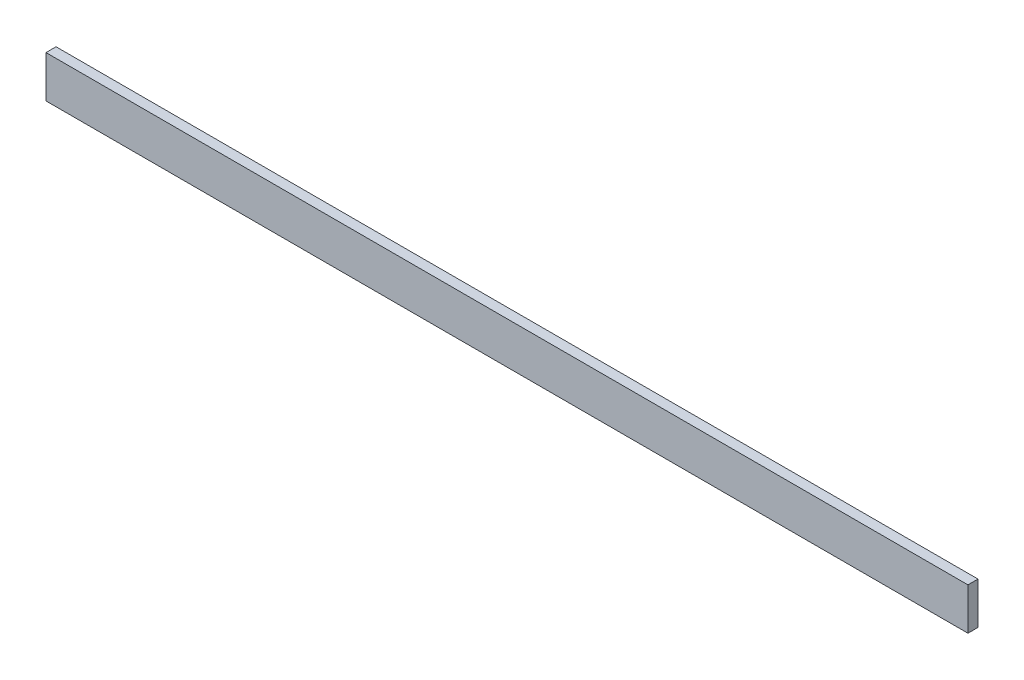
ISO-10303-21;
HEADER;
FILE_DESCRIPTION(('STEP AP214'),'2;1');
FILE_NAME('part.step','',(''),(''),'','','');
FILE_SCHEMA(('AUTOMOTIVE_DESIGN { 1 0 10303 214 1 1 1 1 }'));
ENDSEC;
DATA;
#1=APPLICATION_CONTEXT('core data for automotive mechanical design processes');
#2=APPLICATION_PROTOCOL_DEFINITION('international standard','automotive_design',2000,#1);
#3=PRODUCT_CONTEXT('',#1,'mechanical');
#4=PRODUCT('Part','Part','',(#3));
#5=PRODUCT_RELATED_PRODUCT_CATEGORY('part','',(#4));
#6=PRODUCT_DEFINITION_FORMATION('','',#4);
#7=PRODUCT_DEFINITION_CONTEXT('part definition',#1,'design');
#8=PRODUCT_DEFINITION('design','',#6,#7);
#9=PRODUCT_DEFINITION_SHAPE('','',#8);
#10=(LENGTH_UNIT() NAMED_UNIT(*) SI_UNIT(.MILLI.,.METRE.));
#11=(NAMED_UNIT(*) PLANE_ANGLE_UNIT() SI_UNIT($,.RADIAN.));
#12=(NAMED_UNIT(*) SI_UNIT($,.STERADIAN.) SOLID_ANGLE_UNIT());
#13=UNCERTAINTY_MEASURE_WITH_UNIT(LENGTH_MEASURE(1.E-05),#10,'distance_accuracy_value','');
#14=(GEOMETRIC_REPRESENTATION_CONTEXT(3) GLOBAL_UNCERTAINTY_ASSIGNED_CONTEXT((#13)) GLOBAL_UNIT_ASSIGNED_CONTEXT((#10,
#11,#12)) REPRESENTATION_CONTEXT('',''));
#15=CARTESIAN_POINT('',(0.,0.,0.));
#16=DIRECTION('',(0.,0.,1.));
#17=DIRECTION('',(1.,0.,0.));
#18=AXIS2_PLACEMENT_3D('',#15,#16,#17);
#19=CARTESIAN_POINT('',(550.,25.,12.));
#20=DIRECTION('',(-1.,0.,0.));
#21=DIRECTION('',(0.,0.,1.));
#22=AXIS2_PLACEMENT_3D('',#19,#20,#21);
#23=PLANE('',#22);
#24=DIRECTION('',(0.,1.,0.));
#25=VECTOR('',#24,1.);
#26=CARTESIAN_POINT('',(550.,25.,0.));
#27=LINE('',#26,#25);
#28=CARTESIAN_POINT('',(550.,-25.,0.));
#29=VERTEX_POINT('',#28);
#30=CARTESIAN_POINT('',(550.,25.,0.));
#31=VERTEX_POINT('',#30);
#32=EDGE_CURVE('E96',#29,#31,#27,.T.);
#33=ORIENTED_EDGE('',*,*,#32,.T.);
#34=DIRECTION('',(0.,0.,-1.));
#35=VECTOR('',#34,1.);
#36=CARTESIAN_POINT('',(550.,25.,12.));
#37=LINE('',#36,#35);
#38=CARTESIAN_POINT('',(550.,25.,12.));
#39=VERTEX_POINT('',#38);
#40=EDGE_CURVE('E11',#39,#31,#37,.T.);
#41=ORIENTED_EDGE('',*,*,#40,.F.);
#42=DIRECTION('',(0.,1.,0.));
#43=VECTOR('',#42,1.);
#44=CARTESIAN_POINT('',(550.,25.,12.));
#45=LINE('',#44,#43);
#46=CARTESIAN_POINT('',(550.,-25.,12.));
#47=VERTEX_POINT('',#46);
#48=EDGE_CURVE('E84',#47,#39,#45,.T.);
#49=ORIENTED_EDGE('',*,*,#48,.F.);
#50=DIRECTION('',(0.,0.,-1.));
#51=VECTOR('',#50,1.);
#52=CARTESIAN_POINT('',(550.,-25.,12.));
#53=LINE('',#52,#51);
#54=EDGE_CURVE('E92',#47,#29,#53,.T.);
#55=ORIENTED_EDGE('',*,*,#54,.T.);
#56=EDGE_LOOP('',(#33,#41,#49,#55));
#57=FACE_BOUND('',#56,.T.);
#58=ADVANCED_FACE('F33',(#57),#23,.F.);
#59=CARTESIAN_POINT('',(-550.,25.,12.));
#60=DIRECTION('',(0.,-1.,0.));
#61=DIRECTION('',(0.,0.,-1.));
#62=AXIS2_PLACEMENT_3D('',#59,#60,#61);
#63=PLANE('',#62);
#64=DIRECTION('',(-1.,0.,0.));
#65=VECTOR('',#64,1.);
#66=CARTESIAN_POINT('',(-550.,25.,0.));
#67=LINE('',#66,#65);
#68=CARTESIAN_POINT('',(-550.,25.,0.));
#69=VERTEX_POINT('',#68);
#70=EDGE_CURVE('E88',#31,#69,#67,.T.);
#71=ORIENTED_EDGE('',*,*,#70,.T.);
#72=DIRECTION('',(0.,0.,-1.));
#73=VECTOR('',#72,1.);
#74=CARTESIAN_POINT('',(-550.,25.,12.));
#75=LINE('',#74,#73);
#76=CARTESIAN_POINT('',(-550.,25.,12.));
#77=VERTEX_POINT('',#76);
#78=EDGE_CURVE('E41',#77,#69,#75,.T.);
#79=ORIENTED_EDGE('',*,*,#78,.F.);
#80=DIRECTION('',(-1.,0.,0.));
#81=VECTOR('',#80,1.);
#82=CARTESIAN_POINT('',(-550.,25.,12.));
#83=LINE('',#82,#81);
#84=EDGE_CURVE('E79',#39,#77,#83,.T.);
#85=ORIENTED_EDGE('',*,*,#84,.F.);
#86=ORIENTED_EDGE('',*,*,#40,.T.);
#87=EDGE_LOOP('',(#71,#79,#85,#86));
#88=FACE_BOUND('',#87,.T.);
#89=ADVANCED_FACE('F87',(#88),#63,.F.);
#90=CARTESIAN_POINT('',(-550.,25.,12.));
#91=DIRECTION('',(1.,0.,0.));
#92=DIRECTION('',(0.,0.,-1.));
#93=AXIS2_PLACEMENT_3D('',#90,#91,#92);
#94=PLANE('',#93);
#95=DIRECTION('',(0.,-1.,0.));
#96=VECTOR('',#95,1.);
#97=CARTESIAN_POINT('',(-550.,25.,0.));
#98=LINE('',#97,#96);
#99=CARTESIAN_POINT('',(-550.,-25.,0.));
#100=VERTEX_POINT('',#99);
#101=EDGE_CURVE('E66',#69,#100,#98,.T.);
#102=ORIENTED_EDGE('',*,*,#101,.T.);
#103=DIRECTION('',(0.,0.,-1.));
#104=VECTOR('',#103,1.);
#105=CARTESIAN_POINT('',(-550.,-25.,12.));
#106=LINE('',#105,#104);
#107=CARTESIAN_POINT('',(-550.,-25.,12.));
#108=VERTEX_POINT('',#107);
#109=EDGE_CURVE('E89',#108,#100,#106,.T.);
#110=ORIENTED_EDGE('',*,*,#109,.F.);
#111=DIRECTION('',(0.,-1.,0.));
#112=VECTOR('',#111,1.);
#113=CARTESIAN_POINT('',(-550.,25.,12.));
#114=LINE('',#113,#112);
#115=EDGE_CURVE('E82',#77,#108,#114,.T.);
#116=ORIENTED_EDGE('',*,*,#115,.F.);
#117=ORIENTED_EDGE('',*,*,#78,.T.);
#118=EDGE_LOOP('',(#102,#110,#116,#117));
#119=FACE_BOUND('',#118,.T.);
#120=ADVANCED_FACE('F90',(#119),#94,.F.);
#121=CARTESIAN_POINT('',(-550.,-25.,12.));
#122=DIRECTION('',(0.,1.,0.));
#123=DIRECTION('',(0.,0.,1.));
#124=AXIS2_PLACEMENT_3D('',#121,#122,#123);
#125=PLANE('',#124);
#126=DIRECTION('',(1.,0.,0.));
#127=VECTOR('',#126,1.);
#128=CARTESIAN_POINT('',(-550.,-25.,0.));
#129=LINE('',#128,#127);
#130=EDGE_CURVE('E72',#100,#29,#129,.T.);
#131=ORIENTED_EDGE('',*,*,#130,.T.);
#132=ORIENTED_EDGE('',*,*,#54,.F.);
#133=DIRECTION('',(1.,0.,0.));
#134=VECTOR('',#133,1.);
#135=CARTESIAN_POINT('',(-550.,-25.,12.));
#136=LINE('',#135,#134);
#137=EDGE_CURVE('E49',#108,#47,#136,.T.);
#138=ORIENTED_EDGE('',*,*,#137,.F.);
#139=ORIENTED_EDGE('',*,*,#109,.T.);
#140=EDGE_LOOP('',(#131,#132,#138,#139));
#141=FACE_BOUND('',#140,.T.);
#142=ADVANCED_FACE('F103',(#141),#125,.F.);
#143=CARTESIAN_POINT('',(0.,0.,12.));
#144=DIRECTION('',(0.,0.,1.));
#145=DIRECTION('',(1.,0.,0.));
#146=AXIS2_PLACEMENT_3D('',#143,#144,#145);
#147=PLANE('',#146);
#148=ORIENTED_EDGE('',*,*,#48,.T.);
#149=ORIENTED_EDGE('',*,*,#84,.T.);
#150=ORIENTED_EDGE('',*,*,#115,.T.);
#151=ORIENTED_EDGE('',*,*,#137,.T.);
#152=EDGE_LOOP('',(#148,#149,#150,#151));
#153=FACE_BOUND('',#152,.T.);
#154=ADVANCED_FACE('F80',(#153),#147,.T.);
#155=CARTESIAN_POINT('',(0.,0.,0.));
#156=DIRECTION('',(0.,0.,1.));
#157=DIRECTION('',(1.,0.,0.));
#158=AXIS2_PLACEMENT_3D('',#155,#156,#157);
#159=PLANE('',#158);
#160=ORIENTED_EDGE('',*,*,#32,.F.);
#161=ORIENTED_EDGE('',*,*,#130,.F.);
#162=ORIENTED_EDGE('',*,*,#101,.F.);
#163=ORIENTED_EDGE('',*,*,#70,.F.);
#164=EDGE_LOOP('',(#160,#161,#162,#163));
#165=FACE_BOUND('',#164,.T.);
#166=ADVANCED_FACE('F106',(#165),#159,.F.);
#167=CLOSED_SHELL('',(#58,#89,#120,#142,#154,#166));
#168=MANIFOLD_SOLID_BREP('B2',#167);
#169=ADVANCED_BREP_SHAPE_REPRESENTATION('',(#18,#168),#14);
#170=SHAPE_DEFINITION_REPRESENTATION(#9,#169);
ENDSEC;
END-ISO-10303-21;
